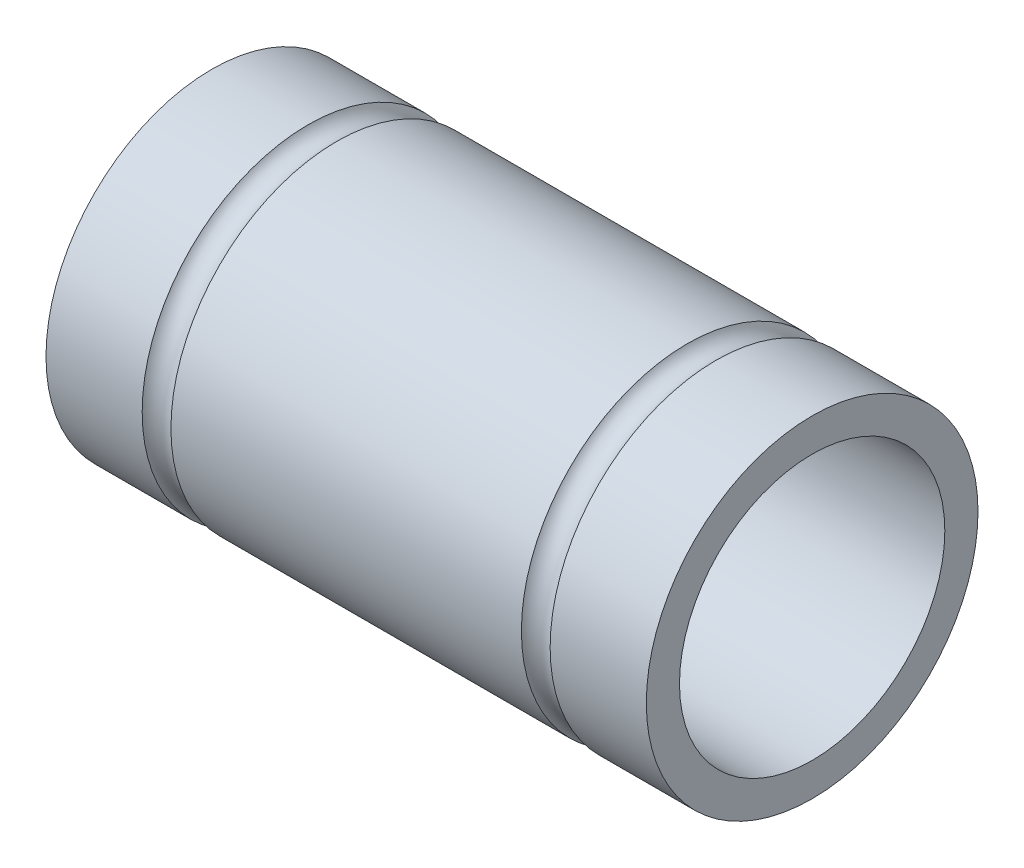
from build123d import *


with BuildPart() as part:
    # Esquisse1 → Base-R_volution (revolve)
    with BuildSketch(Plane.XY, mode=Mode.PRIVATE) as base_r_volution_sk:
        with BuildLine():
            Line((-70, 12), (-15.7, 12))
            Line((-15.7, 12), (-15.7, 15))
            Line((-15.7, 15), (-24.4, 15))
            ThreePointArc((-24.4, 15), (-25.7, 14.248331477), (-27, 15))
            Line((-27, 15), (-58.7, 15))
            ThreePointArc((-58.7, 15), (-60, 14.248331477), (-61.3, 15))
            Line((-61.3, 15), (-70, 15))
            Line((-70, 15), (-70, 12))
        make_face()
    revolve(base_r_volution_sk.sketch.rotate(Axis((-100, 0, 0), (1, 0, 0)), 90), axis=Axis((-100, 0, 0), (1, 0, 0)))


solid = part.part
